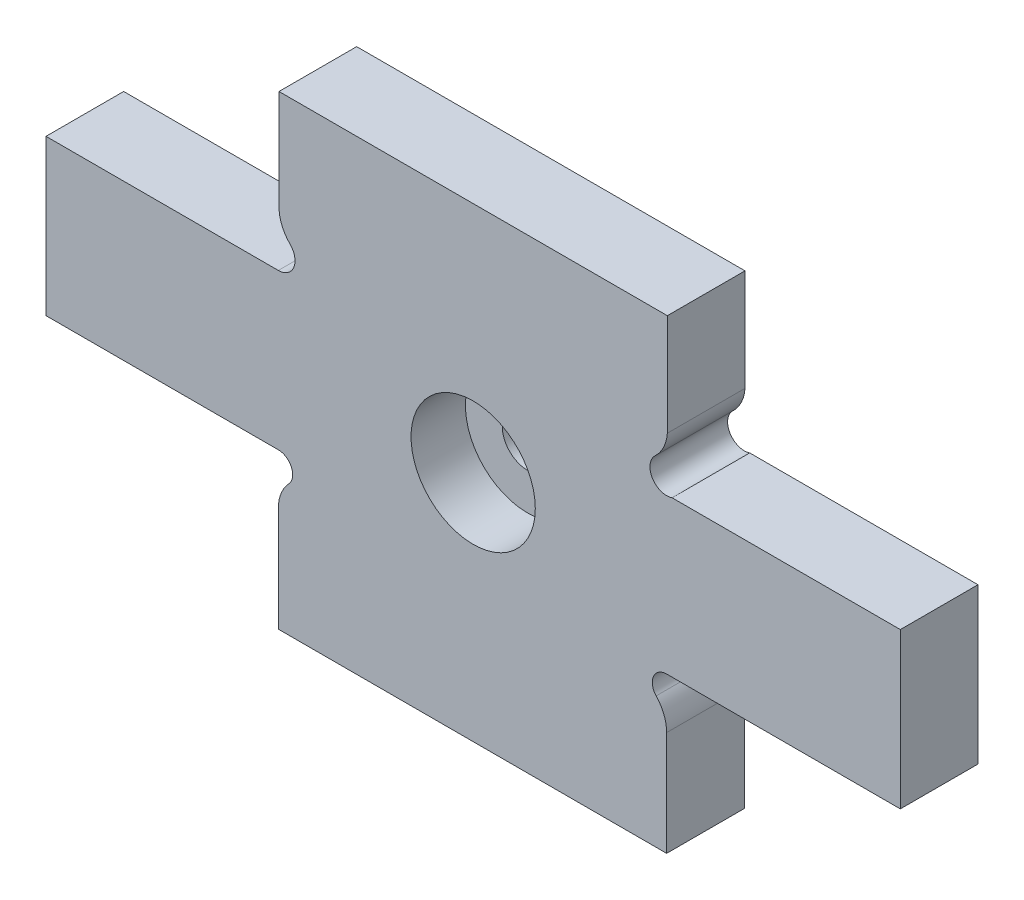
from build123d import *

# Parameters (mm, degrees)
BOSS_EXTRU_1_DEPTH      = 10
ESQUISSE2_R             = 3.25
ENL_V_MAT_EXTRU_1_DEPTH = 10
ESQUISSE3_R             = 8
ENL_V_MAT_EXTRU_2_DEPTH = 7


with BuildPart() as part:
    # Esquisse1 → Boss.-Extru.1 (new body)
    with BuildSketch(Plane.XY):
        with BuildLine():
            Line((24.912519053, -10), (55, -10))
            Line((55, -10), (55, 10))
            Line((55, 10), (25.605454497, 10))
            ThreePointArc((25.605454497, 10), (23.047618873, 10.96182424), (23.492001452, 13.658146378))
            ThreePointArc((23.492001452, 13.658146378), (24.545007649, 15.137881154), (25, 16.896124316))
            Line((25, 16.896124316), (25, 30))
            Line((25, 30), (-25, 30))
            Line((-25, 30), (-25, 16.896124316))
            ThreePointArc((-25, 16.896124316), (-24.563829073, 15.120019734), (-23.518137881, 13.619578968))
            ThreePointArc((-23.518137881, 13.619578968), (-23.114907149, 11.294749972), (-25.087480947, 10))
            Line((-25.087480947, 10), (-55, 10))
            Line((-55, 10), (-55, -10))
            Line((-55, -10), (-25.087480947, -10))
            ThreePointArc((-25.087480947, -10), (-23.390150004, -11.114087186), (-23.737115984, -13.114521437))
            ThreePointArc((-23.737115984, -13.114521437), (-24.737651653, -14.694781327), (-25.087480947, -16.532146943))
            Line((-25.087480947, -16.532146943), (-25.087480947, -30))
            Line((-25.087480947, -30), (24.912519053, -30))
            Line((24.912519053, -30), (24.912519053, -16.532146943))
            ThreePointArc((24.912519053, -16.532146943), (24.562689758, -14.694781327), (23.562154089, -13.114521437))
            ThreePointArc((23.562154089, -13.114521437), (23.21518811, -11.114087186), (24.912519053, -10))
        make_face()
    extrude(amount=BOSS_EXTRU_1_DEPTH)

    # Esquisse2 → Enl_v. mat.-Extru.1 (cut)
    with BuildSketch(Plane.XY):
        Circle(ESQUISSE2_R)
    extrude(amount=ENL_V_MAT_EXTRU_1_DEPTH, mode=Mode.SUBTRACT)

    # Esquisse3 → Enl_v. mat.-Extru.2 (cut)
    with BuildSketch(Plane.XY.offset(10)):
        Circle(ESQUISSE3_R)
    extrude(amount=-ENL_V_MAT_EXTRU_2_DEPTH, mode=Mode.SUBTRACT)


solid = part.part
